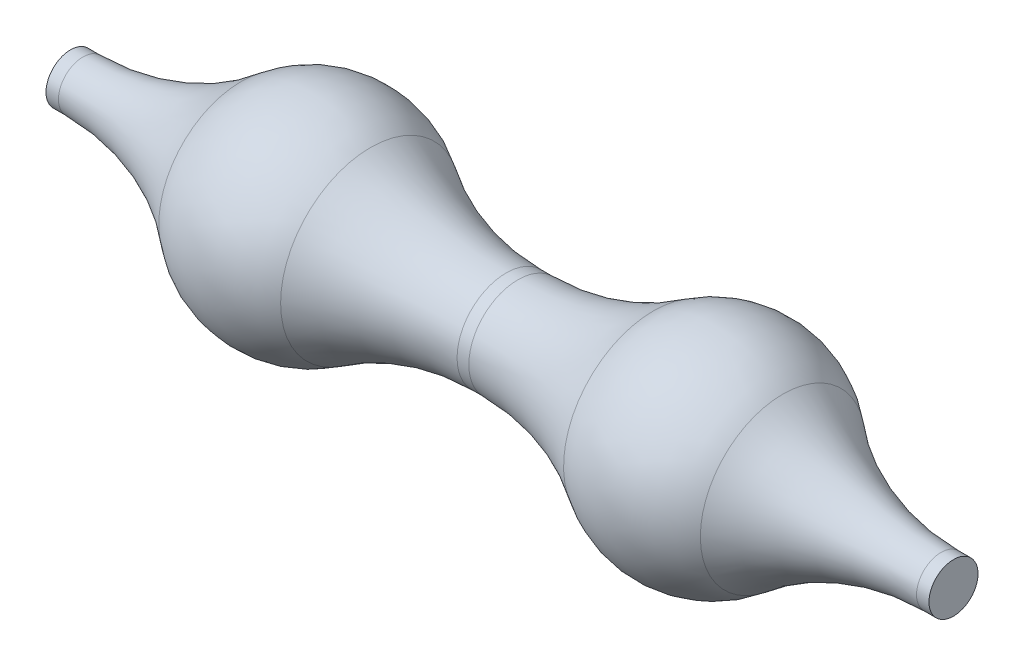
from build123d import *

# Parameters (mm, degrees)
FILLET1_R = 2.5


with BuildPart() as part:
    # Sketch1 → Revolve1 (revolve)
    with BuildSketch(Plane.XY):
        with BuildLine():
            Line((-1.35, 0), (6.3, 0))
            Line((6.3, 0), (7.65, 0))
            Line((7.65, 0), (7.65, 0.25))
            Line((7.65, 0.25), (6.271214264, 0.25))
            ThreePointArc((6.271214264, 0.25), (5.333095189, 1.091918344), (4.220204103, 0.5))
            Line((4.220204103, 0.5), (2.079795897, 0.5))
            ThreePointArc((2.079795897, 0.5), (0.966904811, 1.091918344), (0.028785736, 0.25))
            Line((0.028785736, 0.25), (-1.35, 0.25))
            Line((-1.35, 0.25), (-1.35, 0))
        make_face()
    revolve(axis=Axis((-1.35, 0, 0), (1, 0, 0)))

    # Fillet1
    fillet1_edges = [part.edges().sort_by_distance(p)[0] for p in [
        (0.028785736, -0.25, 0),
        (2.079795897, -0.5, 0),
        (4.220204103, -0.5, 0),
        (6.271214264, -0.25, 0),
    ]]
    fillet(fillet1_edges, radius=FILLET1_R)


solid = part.part
